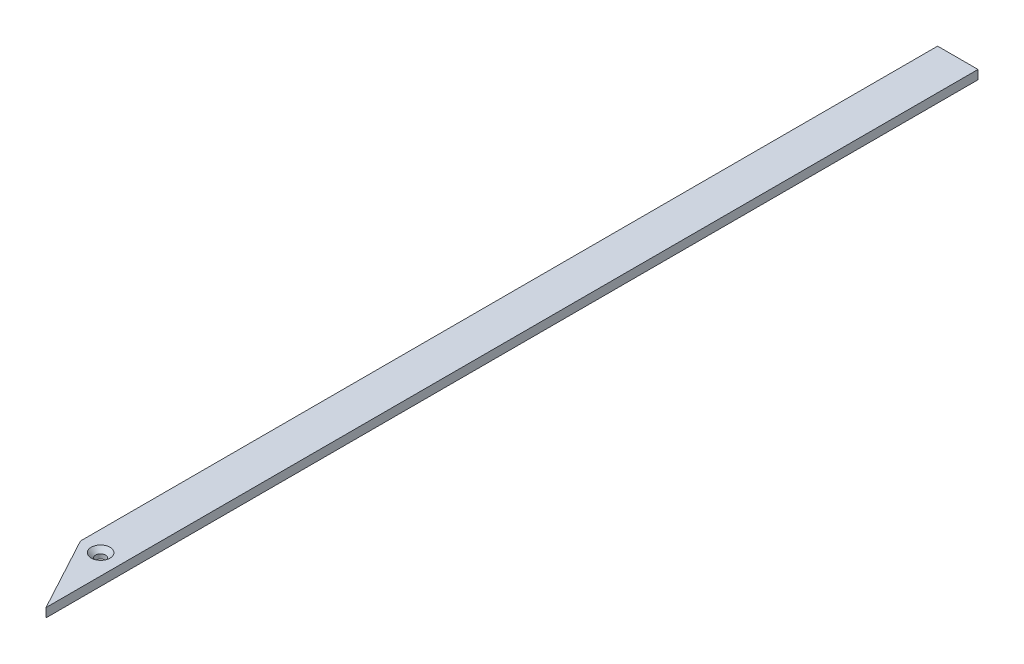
ISO-10303-21;
HEADER;
FILE_DESCRIPTION(('STEP AP214'),'2;1');
FILE_NAME('part.step','',(''),(''),'','','');
FILE_SCHEMA(('AUTOMOTIVE_DESIGN { 1 0 10303 214 1 1 1 1 }'));
ENDSEC;
DATA;
#1=APPLICATION_CONTEXT('core data for automotive mechanical design processes');
#2=APPLICATION_PROTOCOL_DEFINITION('international standard','automotive_design',2000,#1);
#3=PRODUCT_CONTEXT('',#1,'mechanical');
#4=PRODUCT('Part','Part','',(#3));
#5=PRODUCT_RELATED_PRODUCT_CATEGORY('part','',(#4));
#6=PRODUCT_DEFINITION_FORMATION('','',#4);
#7=PRODUCT_DEFINITION_CONTEXT('part definition',#1,'design');
#8=PRODUCT_DEFINITION('design','',#6,#7);
#9=PRODUCT_DEFINITION_SHAPE('','',#8);
#10=(LENGTH_UNIT() NAMED_UNIT(*) SI_UNIT(.MILLI.,.METRE.));
#11=(NAMED_UNIT(*) PLANE_ANGLE_UNIT() SI_UNIT($,.RADIAN.));
#12=(NAMED_UNIT(*) SI_UNIT($,.STERADIAN.) SOLID_ANGLE_UNIT());
#13=UNCERTAINTY_MEASURE_WITH_UNIT(LENGTH_MEASURE(1.E-05),#10,'distance_accuracy_value','');
#14=(GEOMETRIC_REPRESENTATION_CONTEXT(3) GLOBAL_UNCERTAINTY_ASSIGNED_CONTEXT((#13)) GLOBAL_UNIT_ASSIGNED_CONTEXT((#10,
#11,#12)) REPRESENTATION_CONTEXT('',''));
#15=CARTESIAN_POINT('',(0.,0.,0.));
#16=DIRECTION('',(0.,0.,1.));
#17=DIRECTION('',(1.,0.,0.));
#18=AXIS2_PLACEMENT_3D('',#15,#16,#17);
#19=CARTESIAN_POINT('',(-13.5,0.,311.5));
#20=DIRECTION('',(1.,0.,0.));
#21=DIRECTION('',(0.,0.,-1.));
#22=AXIS2_PLACEMENT_3D('',#19,#20,#21);
#23=PLANE('',#22);
#24=DIRECTION('',(0.,0.,-1.));
#25=VECTOR('',#24,1.);
#26=CARTESIAN_POINT('',(-13.5,0.,311.5));
#27=LINE('',#26,#25);
#28=CARTESIAN_POINT('',(-13.5,0.,261.5));
#29=VERTEX_POINT('',#28);
#30=CARTESIAN_POINT('',(-13.5,0.,-311.5));
#31=VERTEX_POINT('',#30);
#32=EDGE_CURVE('E71',#29,#31,#27,.T.);
#33=ORIENTED_EDGE('',*,*,#32,.F.);
#34=DIRECTION('',(0.,1.,0.));
#35=VECTOR('',#34,1.);
#36=CARTESIAN_POINT('',(-13.5,0.,261.5));
#37=LINE('',#36,#35);
#38=CARTESIAN_POINT('',(-13.5,6.,261.5));
#39=VERTEX_POINT('',#38);
#40=EDGE_CURVE('E43',#29,#39,#37,.T.);
#41=ORIENTED_EDGE('',*,*,#40,.T.);
#42=DIRECTION('',(0.,0.,-1.));
#43=VECTOR('',#42,1.);
#44=CARTESIAN_POINT('',(-13.5,6.,311.5));
#45=LINE('',#44,#43);
#46=CARTESIAN_POINT('',(-13.5,6.,-311.5));
#47=VERTEX_POINT('',#46);
#48=EDGE_CURVE('E87',#39,#47,#45,.T.);
#49=ORIENTED_EDGE('',*,*,#48,.T.);
#50=DIRECTION('',(0.,-1.,0.));
#51=VECTOR('',#50,1.);
#52=CARTESIAN_POINT('',(-13.5,0.,-311.5));
#53=LINE('',#52,#51);
#54=EDGE_CURVE('E84',#47,#31,#53,.T.);
#55=ORIENTED_EDGE('',*,*,#54,.T.);
#56=EDGE_LOOP('',(#33,#41,#49,#55));
#57=FACE_BOUND('',#56,.T.);
#58=ADVANCED_FACE('F36',(#57),#23,.F.);
#59=CARTESIAN_POINT('',(-13.5,0.,311.5));
#60=DIRECTION('',(0.,1.,0.));
#61=DIRECTION('',(0.,0.,1.));
#62=AXIS2_PLACEMENT_3D('',#59,#60,#61);
#63=PLANE('',#62);
#64=CARTESIAN_POINT('',(0.,0.,261.5));
#65=DIRECTION('',(0.,1.,0.));
#66=DIRECTION('',(0.,0.,1.));
#67=AXIS2_PLACEMENT_3D('',#64,#65,#66);
#68=CIRCLE('',#67,3.3);
#69=CARTESIAN_POINT('',(0.,0.,264.8));
#70=VERTEX_POINT('',#69);
#71=EDGE_CURVE('E136',#70,#70,#68,.T.);
#72=ORIENTED_EDGE('',*,*,#71,.T.);
#73=EDGE_LOOP('',(#72));
#74=FACE_BOUND('',#73,.T.);
#75=DIRECTION('',(0.,0.,-1.));
#76=VECTOR('',#75,1.);
#77=CARTESIAN_POINT('',(13.5,0.,311.5));
#78=LINE('',#77,#76);
#79=CARTESIAN_POINT('',(13.5,0.,311.5));
#80=VERTEX_POINT('',#79);
#81=CARTESIAN_POINT('',(13.5,0.,-311.5));
#82=VERTEX_POINT('',#81);
#83=EDGE_CURVE('E77',#80,#82,#78,.T.);
#84=ORIENTED_EDGE('',*,*,#83,.F.);
#85=DIRECTION('',(0.475148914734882,0.,0.879905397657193));
#86=VECTOR('',#85,1.);
#87=CARTESIAN_POINT('',(13.5,0.,311.5));
#88=LINE('',#87,#86);
#89=EDGE_CURVE('E57',#80,#29,#88,.F.);
#90=ORIENTED_EDGE('',*,*,#89,.T.);
#91=ORIENTED_EDGE('',*,*,#32,.T.);
#92=DIRECTION('',(1.,0.,0.));
#93=VECTOR('',#92,1.);
#94=CARTESIAN_POINT('',(-13.5,0.,-311.5));
#95=LINE('',#94,#93);
#96=EDGE_CURVE('E74',#31,#82,#95,.T.);
#97=ORIENTED_EDGE('',*,*,#96,.T.);
#98=EDGE_LOOP('',(#84,#90,#91,#97));
#99=FACE_BOUND('',#98,.T.);
#100=ADVANCED_FACE('F73',(#74,#99),#63,.F.);
#101=CARTESIAN_POINT('',(13.5,0.,311.5));
#102=DIRECTION('',(-1.,0.,0.));
#103=DIRECTION('',(0.,0.,1.));
#104=AXIS2_PLACEMENT_3D('',#101,#102,#103);
#105=PLANE('',#104);
#106=DIRECTION('',(0.,1.,0.));
#107=VECTOR('',#106,1.);
#108=CARTESIAN_POINT('',(13.5,0.,-311.5));
#109=LINE('',#108,#107);
#110=CARTESIAN_POINT('',(13.5,6.,-311.5));
#111=VERTEX_POINT('',#110);
#112=EDGE_CURVE('E85',#82,#111,#109,.T.);
#113=ORIENTED_EDGE('',*,*,#112,.T.);
#114=DIRECTION('',(0.,0.,-1.));
#115=VECTOR('',#114,1.);
#116=CARTESIAN_POINT('',(13.5,6.,311.5));
#117=LINE('',#116,#115);
#118=CARTESIAN_POINT('',(13.5,6.,311.5));
#119=VERTEX_POINT('',#118);
#120=EDGE_CURVE('E103',#119,#111,#117,.T.);
#121=ORIENTED_EDGE('',*,*,#120,.F.);
#122=DIRECTION('',(0.,1.,0.));
#123=VECTOR('',#122,1.);
#124=CARTESIAN_POINT('',(13.5,0.,311.5));
#125=LINE('',#124,#123);
#126=EDGE_CURVE('E99',#80,#119,#125,.T.);
#127=ORIENTED_EDGE('',*,*,#126,.F.);
#128=ORIENTED_EDGE('',*,*,#83,.T.);
#129=EDGE_LOOP('',(#113,#121,#127,#128));
#130=FACE_BOUND('',#129,.T.);
#131=ADVANCED_FACE('F109',(#130),#105,.F.);
#132=CARTESIAN_POINT('',(-13.5,6.,311.5));
#133=DIRECTION('',(0.,-1.,0.));
#134=DIRECTION('',(0.,0.,-1.));
#135=AXIS2_PLACEMENT_3D('',#132,#133,#134);
#136=PLANE('',#135);
#137=CARTESIAN_POINT('',(0.,6.,261.5));
#138=DIRECTION('',(0.,1.,0.));
#139=DIRECTION('',(0.,0.,1.));
#140=AXIS2_PLACEMENT_3D('',#137,#138,#139);
#141=CIRCLE('',#140,6.3);
#142=CARTESIAN_POINT('',(0.,6.,267.8));
#143=VERTEX_POINT('',#142);
#144=EDGE_CURVE('E89',#143,#143,#141,.T.);
#145=ORIENTED_EDGE('',*,*,#144,.F.);
#146=EDGE_LOOP('',(#145));
#147=FACE_BOUND('',#146,.T.);
#148=ORIENTED_EDGE('',*,*,#48,.F.);
#149=DIRECTION('',(-0.475148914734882,0.,-0.879905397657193));
#150=VECTOR('',#149,1.);
#151=CARTESIAN_POINT('',(13.5,6.,311.5));
#152=LINE('',#151,#150);
#153=EDGE_CURVE('E11',#39,#119,#152,.F.);
#154=ORIENTED_EDGE('',*,*,#153,.T.);
#155=ORIENTED_EDGE('',*,*,#120,.T.);
#156=DIRECTION('',(-1.,0.,0.));
#157=VECTOR('',#156,1.);
#158=CARTESIAN_POINT('',(-13.5,6.,-311.5));
#159=LINE('',#158,#157);
#160=EDGE_CURVE('E97',#111,#47,#159,.T.);
#161=ORIENTED_EDGE('',*,*,#160,.T.);
#162=EDGE_LOOP('',(#148,#154,#155,#161));
#163=FACE_BOUND('',#162,.T.);
#164=ADVANCED_FACE('F115',(#147,#163),#136,.F.);
#165=CARTESIAN_POINT('',(-13.5,6.,-311.5));
#166=DIRECTION('',(0.,0.,-1.));
#167=DIRECTION('',(-1.,0.,0.));
#168=AXIS2_PLACEMENT_3D('',#165,#166,#167);
#169=PLANE('',#168);
#170=ORIENTED_EDGE('',*,*,#54,.F.);
#171=ORIENTED_EDGE('',*,*,#160,.F.);
#172=ORIENTED_EDGE('',*,*,#112,.F.);
#173=ORIENTED_EDGE('',*,*,#96,.F.);
#174=EDGE_LOOP('',(#170,#171,#172,#173));
#175=FACE_BOUND('',#174,.T.);
#176=ADVANCED_FACE('F82',(#175),#169,.T.);
#177=CARTESIAN_POINT('',(0.,6.,261.5));
#178=DIRECTION('',(0.,1.,0.));
#179=DIRECTION('',(0.,0.,1.));
#180=AXIS2_PLACEMENT_3D('',#177,#178,#179);
#181=CONICAL_SURFACE('',#180,6.3,0.785398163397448);
#182=CARTESIAN_POINT('',(0.,3.,261.5));
#183=DIRECTION('',(0.,1.,0.));
#184=DIRECTION('',(0.,0.,1.));
#185=AXIS2_PLACEMENT_3D('',#182,#183,#184);
#186=CIRCLE('',#185,3.3);
#187=CARTESIAN_POINT('',(0.,3.,264.8));
#188=VERTEX_POINT('',#187);
#189=EDGE_CURVE('E92',#188,#188,#186,.T.);
#190=ORIENTED_EDGE('',*,*,#189,.F.);
#191=EDGE_LOOP('',(#190));
#192=FACE_BOUND('',#191,.T.);
#193=ORIENTED_EDGE('',*,*,#144,.T.);
#194=EDGE_LOOP('',(#193));
#195=FACE_BOUND('',#194,.T.);
#196=ADVANCED_FACE('F123',(#192,#195),#181,.F.);
#197=CARTESIAN_POINT('',(0.,6.,261.5));
#198=DIRECTION('',(0.,1.,0.));
#199=DIRECTION('',(0.,0.,1.));
#200=AXIS2_PLACEMENT_3D('',#197,#198,#199);
#201=CYLINDRICAL_SURFACE('',#200,3.3);
#202=ORIENTED_EDGE('',*,*,#71,.F.);
#203=EDGE_LOOP('',(#202));
#204=FACE_BOUND('',#203,.T.);
#205=ORIENTED_EDGE('',*,*,#189,.T.);
#206=EDGE_LOOP('',(#205));
#207=FACE_BOUND('',#206,.T.);
#208=ADVANCED_FACE('F142',(#204,#207),#201,.F.);
#209=CARTESIAN_POINT('',(13.5,6.,311.5));
#210=DIRECTION('',(0.879905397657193,0.,-0.475148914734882));
#211=DIRECTION('',(-0.475148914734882,0.,-0.879905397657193));
#212=AXIS2_PLACEMENT_3D('',#209,#210,#211);
#213=PLANE('',#212);
#214=ORIENTED_EDGE('',*,*,#153,.F.);
#215=ORIENTED_EDGE('',*,*,#40,.F.);
#216=ORIENTED_EDGE('',*,*,#89,.F.);
#217=ORIENTED_EDGE('',*,*,#126,.T.);
#218=EDGE_LOOP('',(#214,#215,#216,#217));
#219=FACE_BOUND('',#218,.T.);
#220=ADVANCED_FACE('F113',(#219),#213,.F.);
#221=CLOSED_SHELL('',(#58,#100,#131,#164,#176,#196,#208,#220));
#222=MANIFOLD_SOLID_BREP('B2',#221);
#223=ADVANCED_BREP_SHAPE_REPRESENTATION('',(#18,#222),#14);
#224=SHAPE_DEFINITION_REPRESENTATION(#9,#223);
ENDSEC;
END-ISO-10303-21;
